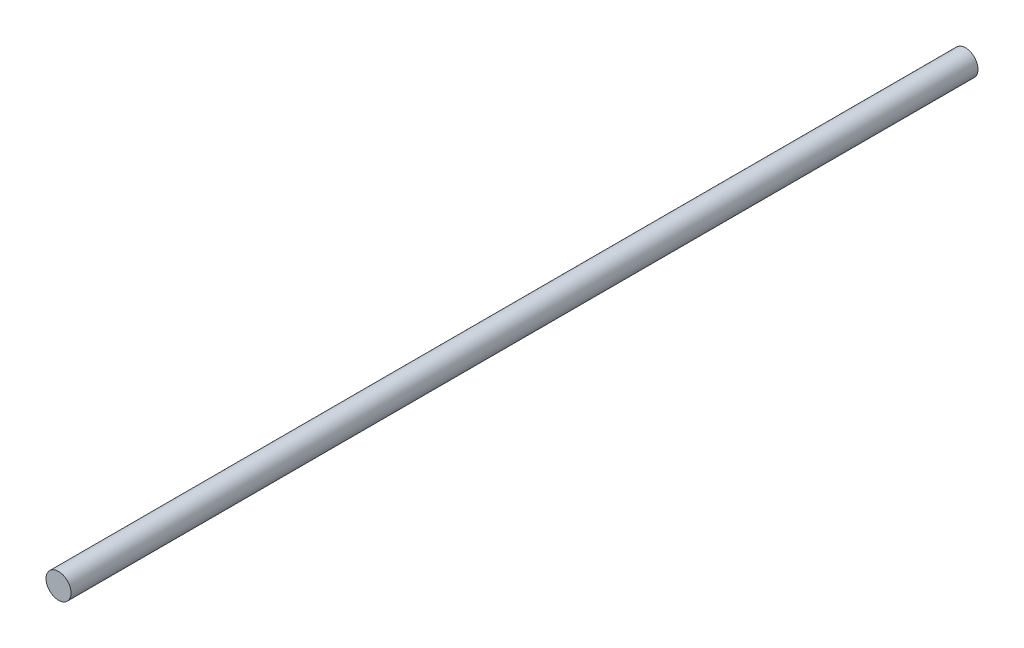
ISO-10303-21;
HEADER;
FILE_DESCRIPTION(('STEP AP214'),'2;1');
FILE_NAME('part.step','',(''),(''),'','','');
FILE_SCHEMA(('AUTOMOTIVE_DESIGN { 1 0 10303 214 1 1 1 1 }'));
ENDSEC;
DATA;
#1=APPLICATION_CONTEXT('core data for automotive mechanical design processes');
#2=APPLICATION_PROTOCOL_DEFINITION('international standard','automotive_design',2000,#1);
#3=PRODUCT_CONTEXT('',#1,'mechanical');
#4=PRODUCT('Part','Part','',(#3));
#5=PRODUCT_RELATED_PRODUCT_CATEGORY('part','',(#4));
#6=PRODUCT_DEFINITION_FORMATION('','',#4);
#7=PRODUCT_DEFINITION_CONTEXT('part definition',#1,'design');
#8=PRODUCT_DEFINITION('design','',#6,#7);
#9=PRODUCT_DEFINITION_SHAPE('','',#8);
#10=(LENGTH_UNIT() NAMED_UNIT(*) SI_UNIT(.MILLI.,.METRE.));
#11=(NAMED_UNIT(*) PLANE_ANGLE_UNIT() SI_UNIT($,.RADIAN.));
#12=(NAMED_UNIT(*) SI_UNIT($,.STERADIAN.) SOLID_ANGLE_UNIT());
#13=UNCERTAINTY_MEASURE_WITH_UNIT(LENGTH_MEASURE(1.E-05),#10,'distance_accuracy_value','');
#14=(GEOMETRIC_REPRESENTATION_CONTEXT(3) GLOBAL_UNCERTAINTY_ASSIGNED_CONTEXT((#13)) GLOBAL_UNIT_ASSIGNED_CONTEXT((#10,
#11,#12)) REPRESENTATION_CONTEXT('',''));
#15=CARTESIAN_POINT('',(0.,0.,0.));
#16=DIRECTION('',(0.,0.,1.));
#17=DIRECTION('',(1.,0.,0.));
#18=AXIS2_PLACEMENT_3D('',#15,#16,#17);
#19=CARTESIAN_POINT('',(0.,0.,-15.5));
#20=DIRECTION('',(0.,0.,1.));
#21=DIRECTION('',(1.,0.,0.));
#22=AXIS2_PLACEMENT_3D('',#19,#20,#21);
#23=PLANE('',#22);
#24=CARTESIAN_POINT('',(0.,0.,-15.5));
#25=DIRECTION('',(0.,0.,-1.));
#26=DIRECTION('',(-1.,0.,0.));
#27=AXIS2_PLACEMENT_3D('',#24,#25,#26);
#28=CIRCLE('',#27,2.);
#29=CARTESIAN_POINT('',(-2.,0.,-15.5));
#30=VERTEX_POINT('',#29);
#31=EDGE_CURVE('E17',#30,#30,#28,.T.);
#32=ORIENTED_EDGE('',*,*,#31,.F.);
#33=EDGE_LOOP('',(#32));
#34=FACE_BOUND('',#33,.T.);
#35=ADVANCED_FACE('F14',(#34),#23,.T.);
#36=CARTESIAN_POINT('',(0.,0.,-160.5));
#37=DIRECTION('',(0.,0.,-1.));
#38=DIRECTION('',(-1.,0.,0.));
#39=AXIS2_PLACEMENT_3D('',#36,#37,#38);
#40=PLANE('',#39);
#41=CARTESIAN_POINT('',(0.,0.,-160.5));
#42=DIRECTION('',(0.,0.,-1.));
#43=DIRECTION('',(-1.,0.,0.));
#44=AXIS2_PLACEMENT_3D('',#41,#42,#43);
#45=CIRCLE('',#44,2.);
#46=CARTESIAN_POINT('',(-2.,0.,-160.5));
#47=VERTEX_POINT('',#46);
#48=EDGE_CURVE('E10',#47,#47,#45,.F.);
#49=ORIENTED_EDGE('',*,*,#48,.F.);
#50=EDGE_LOOP('',(#49));
#51=FACE_BOUND('',#50,.T.);
#52=ADVANCED_FACE('F31',(#51),#40,.T.);
#53=CARTESIAN_POINT('',(0.,0.,-88.));
#54=DIRECTION('',(0.,0.,-1.));
#55=DIRECTION('',(-1.,0.,0.));
#56=AXIS2_PLACEMENT_3D('',#53,#54,#55);
#57=CYLINDRICAL_SURFACE('',#56,2.);
#58=ORIENTED_EDGE('',*,*,#48,.T.);
#59=EDGE_LOOP('',(#58));
#60=FACE_BOUND('',#59,.T.);
#61=ORIENTED_EDGE('',*,*,#31,.T.);
#62=EDGE_LOOP('',(#61));
#63=FACE_BOUND('',#62,.T.);
#64=ADVANCED_FACE('F28',(#60,#63),#57,.T.);
#65=CLOSED_SHELL('',(#35,#52,#64));
#66=MANIFOLD_SOLID_BREP('B1',#65);
#67=ADVANCED_BREP_SHAPE_REPRESENTATION('',(#18,#66),#14);
#68=SHAPE_DEFINITION_REPRESENTATION(#9,#67);
ENDSEC;
END-ISO-10303-21;
